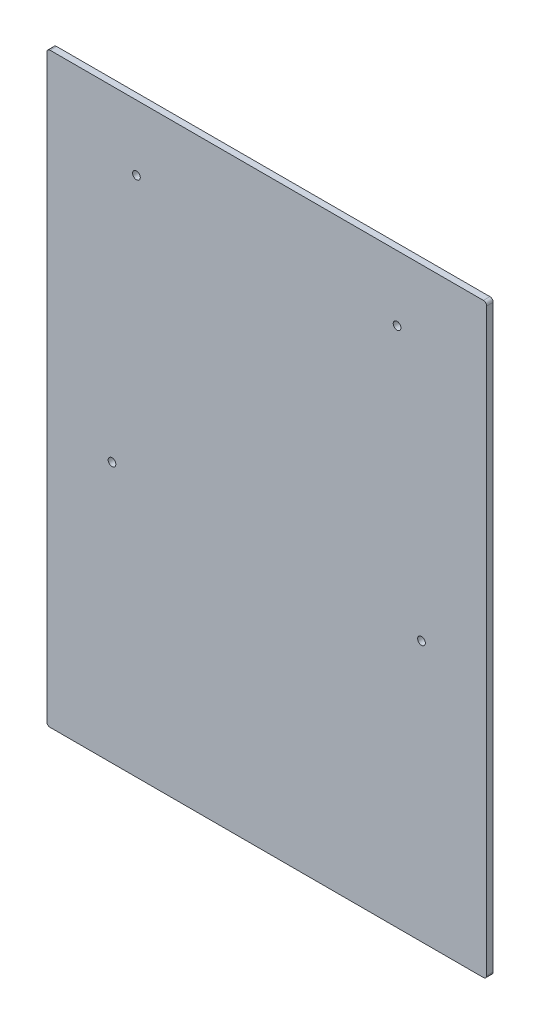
from build123d import *

# Parameters (mm, degrees)
SKETCH1_W           = 342.9
SKETCH1_H           = 457.2
BOSS_EXTRUDE1_DEPTH = 5.08
FILLET1_R           = 2.54
SKETCH2_R           = 3
CUT_EXTRUDE1_DEPTH  = 286.795151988


with BuildPart() as part:
    # Sketch1 → Boss-Extrude1 (new body)
    with BuildSketch(Plane.XY):
        Rectangle(SKETCH1_W, SKETCH1_H)
    extrude(amount=BOSS_EXTRUDE1_DEPTH)

    # Fillet1
    fillet1_edges = [part.edges().sort_by_distance(p)[0] for p in [
        (171.45, -228.6, 2.54),
        (-171.45, -228.6, 2.54),
        (-171.45, 228.6, 2.54),
        (171.45, 228.6, 2.54),
    ]]
    fillet(fillet1_edges, radius=FILLET1_R)

    # Sketch2 → Cut-Extrude1 (cut, through all)
    with BuildSketch(Plane.XY.offset(5.08)):
        with Locations((-101.6, 177.8)):
            Circle(SKETCH2_R)
        with Locations((-120.65, -25.4)):
            Circle(SKETCH2_R)
    cut_extrude1 = extrude(amount=-CUT_EXTRUDE1_DEPTH, mode=Mode.SUBTRACT)

    # Mirror1: Cut-Extrude1 across plane
    add(cut_extrude1.mirror(Plane(origin=(0, 0, 0), x_dir=(0, 0, 1), z_dir=(1, 0, 0))), mode=Mode.SUBTRACT)


solid = part.part
